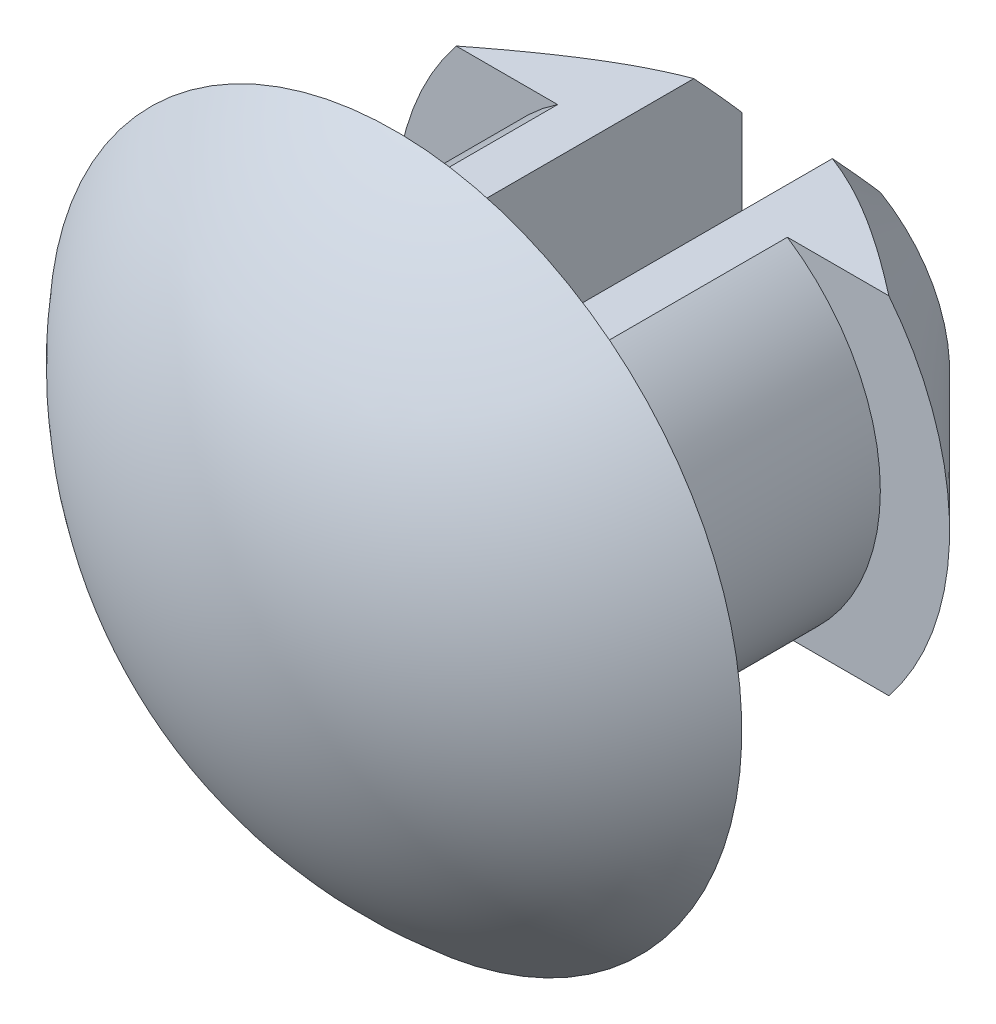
from build123d import *

# Parameters (mm, degrees)
ENL_V_MAT_EXTRU_1_DEPTH      = 5.636809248
ENL_V_MAT_EXTRU_1_DEPTH_BACK = 5.636809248
ESQUISSE4_W                  = 1
ESQUISSE4_H                  = 3
ESQUISSE5_OUTSIDE_W          = 8.642
ESQUISSE5_OUTSIDE_H          = 8.642
ESQUISSE5_OUTSIDE_W_2        = 7.909374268
ESQUISSE5_OUTSIDE_H_2        = 2.5
ENL_V_MAT_EXTRU_2_DEPTH      = 10


with BuildPart() as part:
    # Esquisse3 → R_volution2 (revolve)
    with BuildSketch(Plane(origin=(0, 0, 0), x_dir=(1, 0, 0), z_dir=(0, 1, 0))):
        with BuildLine():
            Line((-2.5, 0), (-1.5, 0))
            Line((-1.5, 0), (-1.5, 2))
            Line((-1.5, 2), (-2, 2))
            Line((-2, 2), (-1, 3))
            Line((-1, 3), (-0.5, 3))
            Line((-0.5, 3), (-0.5, 0))
            Line((-0.5, 0), (0, 0))
            Line((0, 0), (0, -1.173344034))
            ThreePointArc((0, -1.173344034), (-1.380827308, -0.865420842), (-2.5, 0))
        make_face()
    revolve(axis=Axis((0, 0, 0), (0, 0, 1)))

    # Esquisse4 → Enl_v. mat.-Extru.1 (cut, two sides: drawn at the far end of the back side and taken through both)
    with BuildSketch(Plane(origin=(0, 0, 0), x_dir=(1, 0, 0), z_dir=(0, 1, 0)).offset(-ENL_V_MAT_EXTRU_1_DEPTH_BACK)):
        with Locations((0, 1.5)):
            Rectangle(ESQUISSE4_W, ESQUISSE4_H)
    extrude(amount=ENL_V_MAT_EXTRU_1_DEPTH + ENL_V_MAT_EXTRU_1_DEPTH_BACK, mode=Mode.SUBTRACT)

    # Esquisse5 outside → Enl_v. mat.-Extru.2 (cut)
    with BuildSketch(Plane(origin=(0, 0, 0), x_dir=(-1, 0, 0), z_dir=(0, 0, -1))):
        Rectangle(ESQUISSE5_OUTSIDE_W, ESQUISSE5_OUTSIDE_H)
        Rectangle(ESQUISSE5_OUTSIDE_W_2, ESQUISSE5_OUTSIDE_H_2, mode=Mode.SUBTRACT)
    extrude(amount=ENL_V_MAT_EXTRU_2_DEPTH, mode=Mode.SUBTRACT)


solid = part.part
